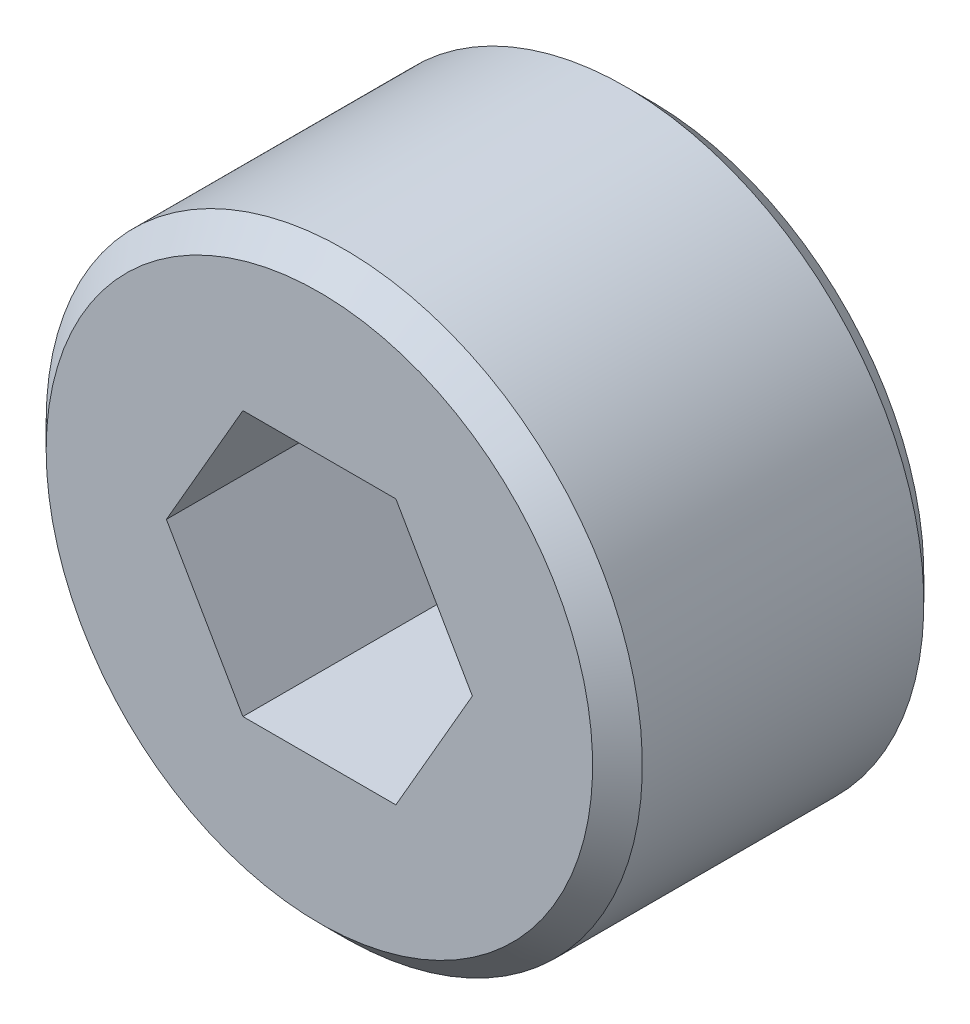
ISO-10303-21;
HEADER;
FILE_DESCRIPTION(('STEP AP214'),'2;1');
FILE_NAME('part.step','',(''),(''),'','','');
FILE_SCHEMA(('AUTOMOTIVE_DESIGN { 1 0 10303 214 1 1 1 1 }'));
ENDSEC;
DATA;
#1=APPLICATION_CONTEXT('core data for automotive mechanical design processes');
#2=APPLICATION_PROTOCOL_DEFINITION('international standard','automotive_design',2000,#1);
#3=PRODUCT_CONTEXT('',#1,'mechanical');
#4=PRODUCT('Part','Part','',(#3));
#5=PRODUCT_RELATED_PRODUCT_CATEGORY('part','',(#4));
#6=PRODUCT_DEFINITION_FORMATION('','',#4);
#7=PRODUCT_DEFINITION_CONTEXT('part definition',#1,'design');
#8=PRODUCT_DEFINITION('design','',#6,#7);
#9=PRODUCT_DEFINITION_SHAPE('','',#8);
#10=(LENGTH_UNIT() NAMED_UNIT(*) SI_UNIT(.MILLI.,.METRE.));
#11=(NAMED_UNIT(*) PLANE_ANGLE_UNIT() SI_UNIT($,.RADIAN.));
#12=(NAMED_UNIT(*) SI_UNIT($,.STERADIAN.) SOLID_ANGLE_UNIT());
#13=UNCERTAINTY_MEASURE_WITH_UNIT(LENGTH_MEASURE(1.E-05),#10,'distance_accuracy_value','');
#14=(GEOMETRIC_REPRESENTATION_CONTEXT(3) GLOBAL_UNCERTAINTY_ASSIGNED_CONTEXT((#13)) GLOBAL_UNIT_ASSIGNED_CONTEXT((#10,
#11,#12)) REPRESENTATION_CONTEXT('',''));
#15=CARTESIAN_POINT('',(0.,0.,0.));
#16=DIRECTION('',(0.,0.,1.));
#17=DIRECTION('',(1.,0.,0.));
#18=AXIS2_PLACEMENT_3D('',#15,#16,#17);
#19=CARTESIAN_POINT('',(0.,0.,0.));
#20=DIRECTION('',(0.,0.,1.));
#21=DIRECTION('',(1.,0.,0.));
#22=AXIS2_PLACEMENT_3D('',#19,#20,#21);
#23=PLANE('',#22);
#24=DIRECTION('',(-0.5,-0.866025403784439,0.));
#25=VECTOR('',#24,1.);
#26=CARTESIAN_POINT('',(3.66617420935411,0.,0.));
#27=LINE('',#26,#25);
#28=CARTESIAN_POINT('',(3.66617420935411,0.,0.));
#29=VERTEX_POINT('',#28);
#30=CARTESIAN_POINT('',(1.83308710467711,-3.175,0.));
#31=VERTEX_POINT('',#30);
#32=EDGE_CURVE('E145',#29,#31,#27,.T.);
#33=ORIENTED_EDGE('',*,*,#32,.F.);
#34=DIRECTION('',(0.5,-0.866025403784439,0.));
#35=VECTOR('',#34,1.);
#36=CARTESIAN_POINT('',(1.83308710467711,3.175,0.));
#37=LINE('',#36,#35);
#38=CARTESIAN_POINT('',(1.83308710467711,3.175,0.));
#39=VERTEX_POINT('',#38);
#40=EDGE_CURVE('E64',#39,#29,#37,.T.);
#41=ORIENTED_EDGE('',*,*,#40,.F.);
#42=DIRECTION('',(1.,0.,0.));
#43=VECTOR('',#42,1.);
#44=CARTESIAN_POINT('',(-1.83308710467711,3.175,0.));
#45=LINE('',#44,#43);
#46=CARTESIAN_POINT('',(-1.83308710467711,3.175,0.));
#47=VERTEX_POINT('',#46);
#48=EDGE_CURVE('E124',#47,#39,#45,.T.);
#49=ORIENTED_EDGE('',*,*,#48,.F.);
#50=DIRECTION('',(0.5,0.866025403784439,0.));
#51=VECTOR('',#50,1.);
#52=CARTESIAN_POINT('',(-3.66617420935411,0.,0.));
#53=LINE('',#52,#51);
#54=CARTESIAN_POINT('',(-3.66617420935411,0.,0.));
#55=VERTEX_POINT('',#54);
#56=EDGE_CURVE('E129',#55,#47,#53,.T.);
#57=ORIENTED_EDGE('',*,*,#56,.F.);
#58=DIRECTION('',(-0.5,0.866025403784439,0.));
#59=VECTOR('',#58,1.);
#60=CARTESIAN_POINT('',(-1.83308710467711,-3.175,0.));
#61=LINE('',#60,#59);
#62=CARTESIAN_POINT('',(-1.83308710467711,-3.175,0.));
#63=VERTEX_POINT('',#62);
#64=EDGE_CURVE('E152',#63,#55,#61,.T.);
#65=ORIENTED_EDGE('',*,*,#64,.F.);
#66=DIRECTION('',(-1.,0.,0.));
#67=VECTOR('',#66,1.);
#68=CARTESIAN_POINT('',(1.83308710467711,-3.175,0.));
#69=LINE('',#68,#67);
#70=EDGE_CURVE('E148',#31,#63,#69,.T.);
#71=ORIENTED_EDGE('',*,*,#70,.F.);
#72=EDGE_LOOP('',(#33,#41,#49,#57,#65,#71));
#73=FACE_BOUND('',#72,.T.);
#74=CARTESIAN_POINT('',(0.,0.,0.));
#75=DIRECTION('',(0.,0.,-1.));
#76=DIRECTION('',(-1.,0.,0.));
#77=AXIS2_PLACEMENT_3D('',#74,#75,#76);
#78=CIRCLE('',#77,6.54812);
#79=CARTESIAN_POINT('',(-6.54812,0.,0.));
#80=VERTEX_POINT('',#79);
#81=EDGE_CURVE('E162',#80,#80,#78,.T.);
#82=ORIENTED_EDGE('',*,*,#81,.T.);
#83=EDGE_LOOP('',(#82));
#84=FACE_BOUND('',#83,.T.);
#85=ADVANCED_FACE('F49',(#73,#84),#23,.F.);
#86=CARTESIAN_POINT('',(-6.54812000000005,0.,7.9375));
#87=DIRECTION('',(0.,0.,-1.));
#88=DIRECTION('',(-1.,0.,0.));
#89=AXIS2_PLACEMENT_3D('',#86,#87,#88);
#90=PLANE('',#89);
#91=DIRECTION('',(1.,0.,0.));
#92=VECTOR('',#91,1.);
#93=CARTESIAN_POINT('',(-1.83308710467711,3.175,7.9375));
#94=LINE('',#93,#92);
#95=CARTESIAN_POINT('',(-1.83308710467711,3.175,7.9375));
#96=VERTEX_POINT('',#95);
#97=CARTESIAN_POINT('',(1.83308710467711,3.175,7.9375));
#98=VERTEX_POINT('',#97);
#99=EDGE_CURVE('E111',#96,#98,#94,.T.);
#100=ORIENTED_EDGE('',*,*,#99,.T.);
#101=DIRECTION('',(0.5,-0.866025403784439,0.));
#102=VECTOR('',#101,1.);
#103=CARTESIAN_POINT('',(1.83308710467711,3.175,7.9375));
#104=LINE('',#103,#102);
#105=CARTESIAN_POINT('',(3.66617420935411,0.,7.9375));
#106=VERTEX_POINT('',#105);
#107=EDGE_CURVE('E104',#98,#106,#104,.T.);
#108=ORIENTED_EDGE('',*,*,#107,.T.);
#109=DIRECTION('',(-0.5,-0.866025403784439,0.));
#110=VECTOR('',#109,1.);
#111=CARTESIAN_POINT('',(3.66617420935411,0.,7.9375));
#112=LINE('',#111,#110);
#113=CARTESIAN_POINT('',(1.83308710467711,-3.175,7.93749999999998));
#114=VERTEX_POINT('',#113);
#115=EDGE_CURVE('E114',#106,#114,#112,.T.);
#116=ORIENTED_EDGE('',*,*,#115,.T.);
#117=DIRECTION('',(-1.,0.,0.));
#118=VECTOR('',#117,1.);
#119=CARTESIAN_POINT('',(1.83308710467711,-3.175,7.93749999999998));
#120=LINE('',#119,#118);
#121=CARTESIAN_POINT('',(-1.83308710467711,-3.175,7.93749999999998));
#122=VERTEX_POINT('',#121);
#123=EDGE_CURVE('E72',#114,#122,#120,.T.);
#124=ORIENTED_EDGE('',*,*,#123,.T.);
#125=DIRECTION('',(-0.5,0.866025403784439,0.));
#126=VECTOR('',#125,1.);
#127=CARTESIAN_POINT('',(-1.83308710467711,-3.175,7.93749999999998));
#128=LINE('',#127,#126);
#129=CARTESIAN_POINT('',(-3.66617420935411,0.,7.9375));
#130=VERTEX_POINT('',#129);
#131=EDGE_CURVE('E134',#122,#130,#128,.T.);
#132=ORIENTED_EDGE('',*,*,#131,.T.);
#133=DIRECTION('',(0.5,0.866025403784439,0.));
#134=VECTOR('',#133,1.);
#135=CARTESIAN_POINT('',(-3.66617420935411,0.,7.9375));
#136=LINE('',#135,#134);
#137=EDGE_CURVE('E138',#130,#96,#136,.T.);
#138=ORIENTED_EDGE('',*,*,#137,.T.);
#139=EDGE_LOOP('',(#100,#108,#116,#124,#132,#138));
#140=FACE_BOUND('',#139,.T.);
#141=CARTESIAN_POINT('',(0.,0.,7.9375));
#142=DIRECTION('',(0.,0.,-1.));
#143=DIRECTION('',(-1.,0.,0.));
#144=AXIS2_PLACEMENT_3D('',#141,#142,#143);
#145=CIRCLE('',#144,6.54812);
#146=CARTESIAN_POINT('',(-6.54812,0.,7.9375));
#147=VERTEX_POINT('',#146);
#148=EDGE_CURVE('E11',#147,#147,#145,.T.);
#149=ORIENTED_EDGE('',*,*,#148,.F.);
#150=EDGE_LOOP('',(#149));
#151=FACE_BOUND('',#150,.T.);
#152=ADVANCED_FACE('F119',(#140,#151),#90,.F.);
#153=CARTESIAN_POINT('',(0.,0.,7.9375));
#154=DIRECTION('',(0.,0.,-1.));
#155=DIRECTION('',(-1.,0.,0.));
#156=AXIS2_PLACEMENT_3D('',#153,#154,#155);
#157=CONICAL_SURFACE('',#156,6.54812,0.785398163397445);
#158=CARTESIAN_POINT('',(0.,0.,7.34187));
#159=DIRECTION('',(0.,0.,-1.));
#160=DIRECTION('',(-1.,0.,0.));
#161=AXIS2_PLACEMENT_3D('',#158,#159,#160);
#162=CIRCLE('',#161,7.14375);
#163=CARTESIAN_POINT('',(-7.14375,0.,7.34187));
#164=VERTEX_POINT('',#163);
#165=EDGE_CURVE('E57',#164,#164,#162,.T.);
#166=ORIENTED_EDGE('',*,*,#165,.F.);
#167=EDGE_LOOP('',(#166));
#168=FACE_BOUND('',#167,.T.);
#169=ORIENTED_EDGE('',*,*,#148,.T.);
#170=EDGE_LOOP('',(#169));
#171=FACE_BOUND('',#170,.T.);
#172=ADVANCED_FACE('F187',(#168,#171),#157,.T.);
#173=CARTESIAN_POINT('',(0.,0.,-10.585154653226));
#174=DIRECTION('',(0.,0.,-1.));
#175=DIRECTION('',(-1.,0.,0.));
#176=AXIS2_PLACEMENT_3D('',#173,#174,#175);
#177=CYLINDRICAL_SURFACE('',#176,7.14375);
#178=CARTESIAN_POINT('',(0.,0.,0.595629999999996));
#179=DIRECTION('',(0.,0.,-1.));
#180=DIRECTION('',(-1.,0.,0.));
#181=AXIS2_PLACEMENT_3D('',#178,#179,#180);
#182=CIRCLE('',#181,7.14375);
#183=CARTESIAN_POINT('',(-7.14375,0.,0.595629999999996));
#184=VERTEX_POINT('',#183);
#185=EDGE_CURVE('E177',#184,#184,#182,.T.);
#186=ORIENTED_EDGE('',*,*,#185,.F.);
#187=EDGE_LOOP('',(#186));
#188=FACE_BOUND('',#187,.T.);
#189=ORIENTED_EDGE('',*,*,#165,.T.);
#190=EDGE_LOOP('',(#189));
#191=FACE_BOUND('',#190,.T.);
#192=ADVANCED_FACE('F185',(#188,#191),#177,.T.);
#193=CARTESIAN_POINT('',(0.,0.,0.595629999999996));
#194=DIRECTION('',(0.,0.,1.));
#195=DIRECTION('',(1.,0.,0.));
#196=AXIS2_PLACEMENT_3D('',#193,#194,#195);
#197=CONICAL_SURFACE('',#196,7.14375,0.78539816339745);
#198=ORIENTED_EDGE('',*,*,#81,.F.);
#199=EDGE_LOOP('',(#198));
#200=FACE_BOUND('',#199,.T.);
#201=ORIENTED_EDGE('',*,*,#185,.T.);
#202=EDGE_LOOP('',(#201));
#203=FACE_BOUND('',#202,.T.);
#204=ADVANCED_FACE('F200',(#200,#203),#197,.T.);
#205=CARTESIAN_POINT('',(1.83308710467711,3.175,7.9375));
#206=DIRECTION('',(0.866025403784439,0.499999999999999,0.));
#207=DIRECTION('',(-0.5,0.866025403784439,0.));
#208=AXIS2_PLACEMENT_3D('',#205,#206,#207);
#209=PLANE('',#208);
#210=ORIENTED_EDGE('',*,*,#40,.T.);
#211=DIRECTION('',(0.,0.,-1.));
#212=VECTOR('',#211,1.);
#213=CARTESIAN_POINT('',(3.66617420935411,0.,7.9375));
#214=LINE('',#213,#212);
#215=EDGE_CURVE('E100',#106,#29,#214,.T.);
#216=ORIENTED_EDGE('',*,*,#215,.F.);
#217=ORIENTED_EDGE('',*,*,#107,.F.);
#218=DIRECTION('',(0.,0.,-1.));
#219=VECTOR('',#218,1.);
#220=CARTESIAN_POINT('',(1.83308710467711,3.175,7.9375));
#221=LINE('',#220,#219);
#222=EDGE_CURVE('E159',#98,#39,#221,.T.);
#223=ORIENTED_EDGE('',*,*,#222,.T.);
#224=EDGE_LOOP('',(#210,#216,#217,#223));
#225=FACE_BOUND('',#224,.T.);
#226=ADVANCED_FACE('F102',(#225),#209,.F.);
#227=CARTESIAN_POINT('',(-1.83308710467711,3.175,7.9375));
#228=DIRECTION('',(0.,1.,0.));
#229=DIRECTION('',(-1.,0.,0.));
#230=AXIS2_PLACEMENT_3D('',#227,#228,#229);
#231=PLANE('',#230);
#232=ORIENTED_EDGE('',*,*,#48,.T.);
#233=ORIENTED_EDGE('',*,*,#222,.F.);
#234=ORIENTED_EDGE('',*,*,#99,.F.);
#235=DIRECTION('',(0.,0.,-1.));
#236=VECTOR('',#235,1.);
#237=CARTESIAN_POINT('',(-1.83308710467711,3.175,7.9375));
#238=LINE('',#237,#236);
#239=EDGE_CURVE('E163',#96,#47,#238,.T.);
#240=ORIENTED_EDGE('',*,*,#239,.T.);
#241=EDGE_LOOP('',(#232,#233,#234,#240));
#242=FACE_BOUND('',#241,.T.);
#243=ADVANCED_FACE('F207',(#242),#231,.F.);
#244=CARTESIAN_POINT('',(-3.66617420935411,0.,7.9375));
#245=DIRECTION('',(-0.866025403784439,0.5,0.));
#246=DIRECTION('',(-0.5,-0.866025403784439,0.));
#247=AXIS2_PLACEMENT_3D('',#244,#245,#246);
#248=PLANE('',#247);
#249=ORIENTED_EDGE('',*,*,#56,.T.);
#250=ORIENTED_EDGE('',*,*,#239,.F.);
#251=ORIENTED_EDGE('',*,*,#137,.F.);
#252=DIRECTION('',(0.,0.,-1.));
#253=VECTOR('',#252,1.);
#254=CARTESIAN_POINT('',(-3.66617420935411,0.,7.9375));
#255=LINE('',#254,#253);
#256=EDGE_CURVE('E166',#130,#55,#255,.T.);
#257=ORIENTED_EDGE('',*,*,#256,.T.);
#258=EDGE_LOOP('',(#249,#250,#251,#257));
#259=FACE_BOUND('',#258,.T.);
#260=ADVANCED_FACE('F216',(#259),#248,.F.);
#261=CARTESIAN_POINT('',(-1.83308710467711,-3.175,7.93749999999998));
#262=DIRECTION('',(-0.866025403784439,-0.499999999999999,0.));
#263=DIRECTION('',(0.5,-0.866025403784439,0.));
#264=AXIS2_PLACEMENT_3D('',#261,#262,#263);
#265=PLANE('',#264);
#266=ORIENTED_EDGE('',*,*,#64,.T.);
#267=ORIENTED_EDGE('',*,*,#256,.F.);
#268=ORIENTED_EDGE('',*,*,#131,.F.);
#269=DIRECTION('',(0.,0.,-1.));
#270=VECTOR('',#269,1.);
#271=CARTESIAN_POINT('',(-1.83308710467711,-3.175,7.93749999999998));
#272=LINE('',#271,#270);
#273=EDGE_CURVE('E169',#122,#63,#272,.T.);
#274=ORIENTED_EDGE('',*,*,#273,.T.);
#275=EDGE_LOOP('',(#266,#267,#268,#274));
#276=FACE_BOUND('',#275,.T.);
#277=ADVANCED_FACE('F213',(#276),#265,.F.);
#278=CARTESIAN_POINT('',(1.83308710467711,-3.175,7.93749999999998));
#279=DIRECTION('',(0.,-1.,0.));
#280=DIRECTION('',(1.,0.,0.));
#281=AXIS2_PLACEMENT_3D('',#278,#279,#280);
#282=PLANE('',#281);
#283=ORIENTED_EDGE('',*,*,#70,.T.);
#284=ORIENTED_EDGE('',*,*,#273,.F.);
#285=ORIENTED_EDGE('',*,*,#123,.F.);
#286=DIRECTION('',(0.,0.,-1.));
#287=VECTOR('',#286,1.);
#288=CARTESIAN_POINT('',(1.83308710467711,-3.175,7.93749999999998));
#289=LINE('',#288,#287);
#290=EDGE_CURVE('E110',#114,#31,#289,.T.);
#291=ORIENTED_EDGE('',*,*,#290,.T.);
#292=EDGE_LOOP('',(#283,#284,#285,#291));
#293=FACE_BOUND('',#292,.T.);
#294=ADVANCED_FACE('F210',(#293),#282,.F.);
#295=CARTESIAN_POINT('',(3.66617420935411,0.,7.9375));
#296=DIRECTION('',(0.866025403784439,-0.5,0.));
#297=DIRECTION('',(0.5,0.866025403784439,0.));
#298=AXIS2_PLACEMENT_3D('',#295,#296,#297);
#299=PLANE('',#298);
#300=ORIENTED_EDGE('',*,*,#32,.T.);
#301=ORIENTED_EDGE('',*,*,#290,.F.);
#302=ORIENTED_EDGE('',*,*,#115,.F.);
#303=ORIENTED_EDGE('',*,*,#215,.T.);
#304=EDGE_LOOP('',(#300,#301,#302,#303));
#305=FACE_BOUND('',#304,.T.);
#306=ADVANCED_FACE('F115',(#305),#299,.F.);
#307=CLOSED_SHELL('',(#85,#152,#172,#192,#204,#226,#243,#260,#277,#294,#306));
#308=MANIFOLD_SOLID_BREP('B2',#307);
#309=ADVANCED_BREP_SHAPE_REPRESENTATION('',(#18,#308),#14);
#310=SHAPE_DEFINITION_REPRESENTATION(#9,#309);
ENDSEC;
END-ISO-10303-21;
